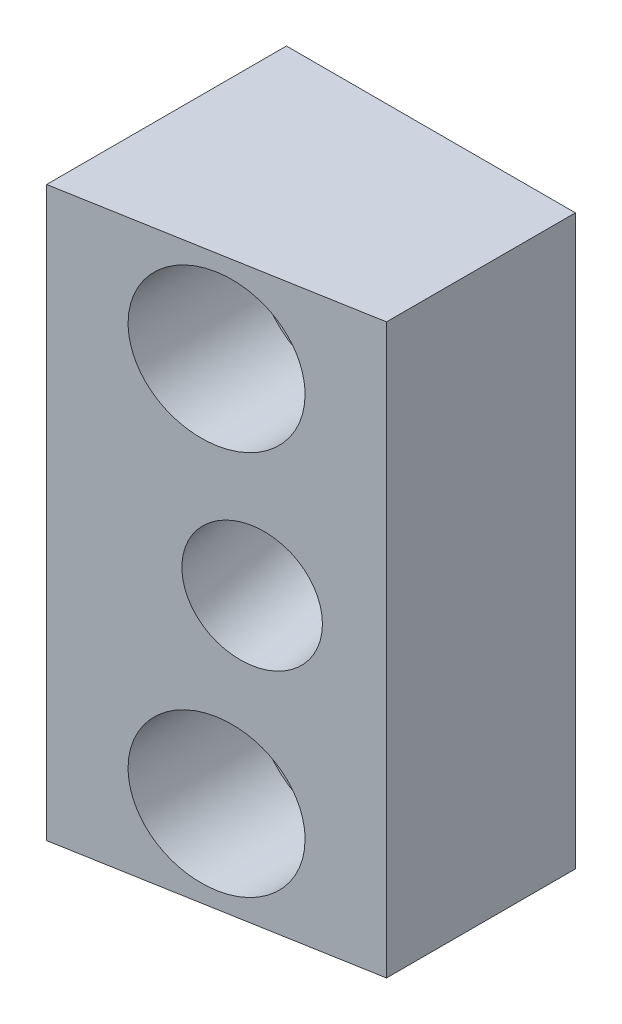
ISO-10303-21;
HEADER;
FILE_DESCRIPTION(('STEP AP214'),'2;1');
FILE_NAME('part.step','',(''),(''),'','','');
FILE_SCHEMA(('AUTOMOTIVE_DESIGN { 1 0 10303 214 1 1 1 1 }'));
ENDSEC;
DATA;
#1=APPLICATION_CONTEXT('core data for automotive mechanical design processes');
#2=APPLICATION_PROTOCOL_DEFINITION('international standard','automotive_design',2000,#1);
#3=PRODUCT_CONTEXT('',#1,'mechanical');
#4=PRODUCT('Part','Part','',(#3));
#5=PRODUCT_RELATED_PRODUCT_CATEGORY('part','',(#4));
#6=PRODUCT_DEFINITION_FORMATION('','',#4);
#7=PRODUCT_DEFINITION_CONTEXT('part definition',#1,'design');
#8=PRODUCT_DEFINITION('design','',#6,#7);
#9=PRODUCT_DEFINITION_SHAPE('','',#8);
#10=(LENGTH_UNIT() NAMED_UNIT(*) SI_UNIT(.MILLI.,.METRE.));
#11=(NAMED_UNIT(*) PLANE_ANGLE_UNIT() SI_UNIT($,.RADIAN.));
#12=(NAMED_UNIT(*) SI_UNIT($,.STERADIAN.) SOLID_ANGLE_UNIT());
#13=UNCERTAINTY_MEASURE_WITH_UNIT(LENGTH_MEASURE(1.E-05),#10,'distance_accuracy_value','');
#14=(GEOMETRIC_REPRESENTATION_CONTEXT(3) GLOBAL_UNCERTAINTY_ASSIGNED_CONTEXT((#13)) GLOBAL_UNIT_ASSIGNED_CONTEXT((#10,
#11,#12)) REPRESENTATION_CONTEXT('',''));
#15=CARTESIAN_POINT('',(0.,0.,0.));
#16=DIRECTION('',(0.,0.,1.));
#17=DIRECTION('',(1.,0.,0.));
#18=AXIS2_PLACEMENT_3D('',#15,#16,#17);
#19=CARTESIAN_POINT('',(19.05,62.865,0.));
#20=DIRECTION('',(0.,0.,1.));
#21=DIRECTION('',(1.,0.,0.));
#22=AXIS2_PLACEMENT_3D('',#19,#20,#21);
#23=PLANE('',#22);
#24=CARTESIAN_POINT('',(-0.871707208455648,25.4,0.));
#25=DIRECTION('',(0.,0.,1.));
#26=DIRECTION('',(1.,0.,0.));
#27=AXIS2_PLACEMENT_3D('',#24,#25,#26);
#28=ELLIPSE('',#27,8.12341289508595,8.);
#29=CARTESIAN_POINT('',(7.2517056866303,25.4,0.));
#30=VERTEX_POINT('',#29);
#31=EDGE_CURVE('E114',#30,#30,#28,.T.);
#32=ORIENTED_EDGE('',*,*,#31,.T.);
#33=EDGE_LOOP('',(#32));
#34=FACE_BOUND('',#33,.T.);
#35=CARTESIAN_POINT('',(0.,0.,0.));
#36=DIRECTION('',(0.,0.,1.));
#37=DIRECTION('',(1.,0.,0.));
#38=AXIS2_PLACEMENT_3D('',#35,#36,#37);
#39=CIRCLE('',#38,6.7437);
#40=CARTESIAN_POINT('',(6.7437,0.,0.));
#41=VERTEX_POINT('',#40);
#42=EDGE_CURVE('E77',#41,#41,#39,.F.);
#43=ORIENTED_EDGE('',*,*,#42,.F.);
#44=EDGE_LOOP('',(#43));
#45=FACE_BOUND('',#44,.T.);
#46=DIRECTION('',(-1.,0.,0.));
#47=VECTOR('',#46,1.);
#48=CARTESIAN_POINT('',(19.05,-12.065,0.));
#49=LINE('',#48,#47);
#50=CARTESIAN_POINT('',(19.05,-12.065,0.));
#51=VERTEX_POINT('',#50);
#52=CARTESIAN_POINT('',(-19.05,-12.065,0.));
#53=VERTEX_POINT('',#52);
#54=EDGE_CURVE('E60',#51,#53,#49,.T.);
#55=ORIENTED_EDGE('',*,*,#54,.T.);
#56=DIRECTION('',(0.,-1.,0.));
#57=VECTOR('',#56,1.);
#58=CARTESIAN_POINT('',(-19.05,62.865,0.));
#59=LINE('',#58,#57);
#60=CARTESIAN_POINT('',(-19.05,62.865,0.));
#61=VERTEX_POINT('',#60);
#62=EDGE_CURVE('E26',#61,#53,#59,.T.);
#63=ORIENTED_EDGE('',*,*,#62,.F.);
#64=DIRECTION('',(-1.,0.,0.));
#65=VECTOR('',#64,1.);
#66=CARTESIAN_POINT('',(19.05,62.865,0.));
#67=LINE('',#66,#65);
#68=CARTESIAN_POINT('',(19.05,62.865,0.));
#69=VERTEX_POINT('',#68);
#70=EDGE_CURVE('E72',#69,#61,#67,.T.);
#71=ORIENTED_EDGE('',*,*,#70,.F.);
#72=DIRECTION('',(0.,-1.,0.));
#73=VECTOR('',#72,1.);
#74=CARTESIAN_POINT('',(19.05,62.865,0.));
#75=LINE('',#74,#73);
#76=EDGE_CURVE('E10',#69,#51,#75,.T.);
#77=ORIENTED_EDGE('',*,*,#76,.T.);
#78=EDGE_LOOP('',(#55,#63,#71,#77));
#79=FACE_BOUND('',#78,.T.);
#80=CARTESIAN_POINT('',(0.,50.8,0.));
#81=DIRECTION('',(0.,0.,1.));
#82=DIRECTION('',(1.,0.,0.));
#83=AXIS2_PLACEMENT_3D('',#80,#81,#82);
#84=CIRCLE('',#83,6.7437);
#85=CARTESIAN_POINT('',(6.7437,50.8,0.));
#86=VERTEX_POINT('',#85);
#87=EDGE_CURVE('E21',#86,#86,#84,.F.);
#88=ORIENTED_EDGE('',*,*,#87,.F.);
#89=EDGE_LOOP('',(#88));
#90=FACE_BOUND('',#89,.T.);
#91=ADVANCED_FACE('F17',(#34,#45,#79,#90),#23,.F.);
#92=CARTESIAN_POINT('',(-19.05,62.865,31.623));
#93=DIRECTION('',(-0.173648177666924,0.,-0.984807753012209));
#94=DIRECTION('',(-0.984807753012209,0.,0.173648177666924));
#95=AXIS2_PLACEMENT_3D('',#92,#93,#94);
#96=PLANE('',#95);
#97=CARTESIAN_POINT('',(3.9880016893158,25.4,27.5607787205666));
#98=DIRECTION('',(0.173648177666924,0.,0.984807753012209));
#99=DIRECTION('',(0.984807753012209,0.,-0.173648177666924));
#100=AXIS2_PLACEMENT_3D('',#97,#98,#99);
#101=CIRCLE('',#100,8.);
#102=CARTESIAN_POINT('',(11.8664637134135,25.4,26.1715932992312));
#103=VERTEX_POINT('',#102);
#104=EDGE_CURVE('E259',#103,#103,#101,.T.);
#105=ORIENTED_EDGE('',*,*,#104,.F.);
#106=EDGE_LOOP('',(#105));
#107=FACE_BOUND('',#106,.T.);
#108=CARTESIAN_POINT('',(0.,0.,28.2639710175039));
#109=DIRECTION('',(-0.173648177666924,0.,-0.984807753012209));
#110=DIRECTION('',(-0.984807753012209,0.,0.173648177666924));
#111=AXIS2_PLACEMENT_3D('',#108,#109,#110);
#112=ELLIPSE('',#111,10.0717119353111,9.9187);
#113=CARTESIAN_POINT('',(-9.91869999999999,0.,30.0129054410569));
#114=VERTEX_POINT('',#113);
#115=EDGE_CURVE('E80',#114,#114,#112,.F.);
#116=ORIENTED_EDGE('',*,*,#115,.F.);
#117=EDGE_LOOP('',(#116));
#118=FACE_BOUND('',#117,.T.);
#119=DIRECTION('',(0.984807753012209,0.,-0.173648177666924));
#120=VECTOR('',#119,1.);
#121=CARTESIAN_POINT('',(-19.05,-12.065,31.623));
#122=LINE('',#121,#120);
#123=CARTESIAN_POINT('',(-19.05,-12.065,31.623));
#124=VERTEX_POINT('',#123);
#125=CARTESIAN_POINT('',(19.05,-12.065,24.9049420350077));
#126=VERTEX_POINT('',#125);
#127=EDGE_CURVE('E88',#124,#126,#122,.T.);
#128=ORIENTED_EDGE('',*,*,#127,.T.);
#129=DIRECTION('',(0.,-1.,0.));
#130=VECTOR('',#129,1.);
#131=CARTESIAN_POINT('',(19.05,62.865,24.9049420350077));
#132=LINE('',#131,#130);
#133=CARTESIAN_POINT('',(19.05,62.865,24.9049420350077));
#134=VERTEX_POINT('',#133);
#135=EDGE_CURVE('E76',#134,#126,#132,.T.);
#136=ORIENTED_EDGE('',*,*,#135,.F.);
#137=DIRECTION('',(0.984807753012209,0.,-0.173648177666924));
#138=VECTOR('',#137,1.);
#139=CARTESIAN_POINT('',(-19.05,62.865,31.623));
#140=LINE('',#139,#138);
#141=CARTESIAN_POINT('',(-19.05,62.865,31.623));
#142=VERTEX_POINT('',#141);
#143=EDGE_CURVE('E34',#142,#134,#140,.T.);
#144=ORIENTED_EDGE('',*,*,#143,.F.);
#145=DIRECTION('',(0.,-1.,0.));
#146=VECTOR('',#145,1.);
#147=CARTESIAN_POINT('',(-19.05,62.865,31.623));
#148=LINE('',#147,#146);
#149=EDGE_CURVE('E96',#142,#124,#148,.T.);
#150=ORIENTED_EDGE('',*,*,#149,.T.);
#151=EDGE_LOOP('',(#128,#136,#144,#150));
#152=FACE_BOUND('',#151,.T.);
#153=CARTESIAN_POINT('',(0.,50.8,28.2639710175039));
#154=DIRECTION('',(-0.173648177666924,0.,-0.984807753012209));
#155=DIRECTION('',(-0.984807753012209,0.,0.173648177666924));
#156=AXIS2_PLACEMENT_3D('',#153,#154,#155);
#157=ELLIPSE('',#156,10.0717119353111,9.9187);
#158=CARTESIAN_POINT('',(-9.91869999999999,50.8,30.0129054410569));
#159=VERTEX_POINT('',#158);
#160=EDGE_CURVE('E101',#159,#159,#157,.F.);
#161=ORIENTED_EDGE('',*,*,#160,.F.);
#162=EDGE_LOOP('',(#161));
#163=FACE_BOUND('',#162,.T.);
#164=ADVANCED_FACE('F143',(#107,#118,#152,#163),#96,.F.);
#165=CARTESIAN_POINT('',(19.05,62.865,24.9049420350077));
#166=DIRECTION('',(-1.,0.,0.));
#167=DIRECTION('',(0.,0.,1.));
#168=AXIS2_PLACEMENT_3D('',#165,#166,#167);
#169=PLANE('',#168);
#170=DIRECTION('',(0.,0.,-1.));
#171=VECTOR('',#170,1.);
#172=CARTESIAN_POINT('',(19.05,-12.065,24.9049420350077));
#173=LINE('',#172,#171);
#174=EDGE_CURVE('E64',#126,#51,#173,.T.);
#175=ORIENTED_EDGE('',*,*,#174,.T.);
#176=ORIENTED_EDGE('',*,*,#76,.F.);
#177=DIRECTION('',(0.,0.,-1.));
#178=VECTOR('',#177,1.);
#179=CARTESIAN_POINT('',(19.05,62.865,24.9049420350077));
#180=LINE('',#179,#178);
#181=EDGE_CURVE('E90',#134,#69,#180,.T.);
#182=ORIENTED_EDGE('',*,*,#181,.F.);
#183=ORIENTED_EDGE('',*,*,#135,.T.);
#184=EDGE_LOOP('',(#175,#176,#182,#183));
#185=FACE_BOUND('',#184,.T.);
#186=ADVANCED_FACE('F19',(#185),#169,.F.);
#187=CARTESIAN_POINT('',(-19.05,62.865,0.));
#188=DIRECTION('',(1.,0.,0.));
#189=DIRECTION('',(0.,1.,0.));
#190=AXIS2_PLACEMENT_3D('',#187,#188,#189);
#191=PLANE('',#190);
#192=DIRECTION('',(0.,0.,1.));
#193=VECTOR('',#192,1.);
#194=CARTESIAN_POINT('',(-19.05,-12.065,0.));
#195=LINE('',#194,#193);
#196=EDGE_CURVE('E65',#53,#124,#195,.T.);
#197=ORIENTED_EDGE('',*,*,#196,.T.);
#198=ORIENTED_EDGE('',*,*,#149,.F.);
#199=DIRECTION('',(0.,0.,1.));
#200=VECTOR('',#199,1.);
#201=CARTESIAN_POINT('',(-19.05,62.865,0.));
#202=LINE('',#201,#200);
#203=EDGE_CURVE('E39',#61,#142,#202,.T.);
#204=ORIENTED_EDGE('',*,*,#203,.F.);
#205=ORIENTED_EDGE('',*,*,#62,.T.);
#206=EDGE_LOOP('',(#197,#198,#204,#205));
#207=FACE_BOUND('',#206,.T.);
#208=ADVANCED_FACE('F154',(#207),#191,.F.);
#209=CARTESIAN_POINT('',(19.05,62.865,0.));
#210=DIRECTION('',(0.,1.,0.));
#211=DIRECTION('',(-1.,0.,0.));
#212=AXIS2_PLACEMENT_3D('',#209,#210,#211);
#213=PLANE('',#212);
#214=ORIENTED_EDGE('',*,*,#181,.T.);
#215=ORIENTED_EDGE('',*,*,#70,.T.);
#216=ORIENTED_EDGE('',*,*,#203,.T.);
#217=ORIENTED_EDGE('',*,*,#143,.T.);
#218=EDGE_LOOP('',(#214,#215,#216,#217));
#219=FACE_BOUND('',#218,.T.);
#220=ADVANCED_FACE('F156',(#219),#213,.T.);
#221=CARTESIAN_POINT('',(19.05,-12.065,0.));
#222=DIRECTION('',(0.,1.,0.));
#223=DIRECTION('',(-1.,0.,0.));
#224=AXIS2_PLACEMENT_3D('',#221,#222,#223);
#225=PLANE('',#224);
#226=ORIENTED_EDGE('',*,*,#174,.F.);
#227=ORIENTED_EDGE('',*,*,#127,.F.);
#228=ORIENTED_EDGE('',*,*,#196,.F.);
#229=ORIENTED_EDGE('',*,*,#54,.F.);
#230=EDGE_LOOP('',(#226,#227,#228,#229));
#231=FACE_BOUND('',#230,.T.);
#232=ADVANCED_FACE('F61',(#231),#225,.F.);
#233=CARTESIAN_POINT('',(0.,0.,18.6715708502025));
#234=DIRECTION('',(0.,0.,1.));
#235=DIRECTION('',(1.,0.,0.));
#236=AXIS2_PLACEMENT_3D('',#233,#234,#235);
#237=CYLINDRICAL_SURFACE('',#236,6.7437);
#238=CARTESIAN_POINT('',(0.,0.,13.208));
#239=DIRECTION('',(0.,0.,1.));
#240=DIRECTION('',(1.,0.,0.));
#241=AXIS2_PLACEMENT_3D('',#238,#239,#240);
#242=CIRCLE('',#241,6.7437);
#243=CARTESIAN_POINT('',(6.7437,0.,13.208));
#244=VERTEX_POINT('',#243);
#245=EDGE_CURVE('E84',#244,#244,#242,.T.);
#246=ORIENTED_EDGE('',*,*,#245,.T.);
#247=EDGE_LOOP('',(#246));
#248=FACE_BOUND('',#247,.T.);
#249=ORIENTED_EDGE('',*,*,#42,.T.);
#250=EDGE_LOOP('',(#249));
#251=FACE_BOUND('',#250,.T.);
#252=ADVANCED_FACE('F123',(#248,#251),#237,.F.);
#253=CARTESIAN_POINT('',(0.,0.,18.6715708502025));
#254=DIRECTION('',(0.,0.,1.));
#255=DIRECTION('',(1.,0.,0.));
#256=AXIS2_PLACEMENT_3D('',#253,#254,#255);
#257=CYLINDRICAL_SURFACE('',#256,9.9187);
#258=CARTESIAN_POINT('',(0.,0.,13.208));
#259=DIRECTION('',(0.,0.,1.));
#260=DIRECTION('',(1.,0.,0.));
#261=AXIS2_PLACEMENT_3D('',#258,#259,#260);
#262=CIRCLE('',#261,9.9187);
#263=CARTESIAN_POINT('',(9.9187,0.,13.208));
#264=VERTEX_POINT('',#263);
#265=EDGE_CURVE('E107',#264,#264,#262,.T.);
#266=ORIENTED_EDGE('',*,*,#265,.F.);
#267=EDGE_LOOP('',(#266));
#268=FACE_BOUND('',#267,.T.);
#269=ORIENTED_EDGE('',*,*,#115,.T.);
#270=EDGE_LOOP('',(#269));
#271=FACE_BOUND('',#270,.T.);
#272=ADVANCED_FACE('F129',(#268,#271),#257,.F.);
#273=CARTESIAN_POINT('',(6.7437,0.,13.208));
#274=DIRECTION('',(0.,0.,1.));
#275=DIRECTION('',(1.,0.,0.));
#276=AXIS2_PLACEMENT_3D('',#273,#274,#275);
#277=PLANE('',#276);
#278=ORIENTED_EDGE('',*,*,#265,.T.);
#279=EDGE_LOOP('',(#278));
#280=FACE_BOUND('',#279,.T.);
#281=ORIENTED_EDGE('',*,*,#245,.F.);
#282=EDGE_LOOP('',(#281));
#283=FACE_BOUND('',#282,.T.);
#284=ADVANCED_FACE('F126',(#280,#283),#277,.T.);
#285=CARTESIAN_POINT('',(0.,50.8,18.6715708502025));
#286=DIRECTION('',(0.,0.,1.));
#287=DIRECTION('',(1.,0.,0.));
#288=AXIS2_PLACEMENT_3D('',#285,#286,#287);
#289=CYLINDRICAL_SURFACE('',#288,6.7437);
#290=CARTESIAN_POINT('',(0.,50.8,13.208));
#291=DIRECTION('',(0.,0.,1.));
#292=DIRECTION('',(1.,0.,0.));
#293=AXIS2_PLACEMENT_3D('',#290,#291,#292);
#294=CIRCLE('',#293,6.7437);
#295=CARTESIAN_POINT('',(6.7437,50.8,13.208));
#296=VERTEX_POINT('',#295);
#297=EDGE_CURVE('E103',#296,#296,#294,.T.);
#298=ORIENTED_EDGE('',*,*,#297,.T.);
#299=EDGE_LOOP('',(#298));
#300=FACE_BOUND('',#299,.T.);
#301=ORIENTED_EDGE('',*,*,#87,.T.);
#302=EDGE_LOOP('',(#301));
#303=FACE_BOUND('',#302,.T.);
#304=ADVANCED_FACE('F128',(#300,#303),#289,.F.);
#305=CARTESIAN_POINT('',(0.,50.8,18.6715708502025));
#306=DIRECTION('',(0.,0.,1.));
#307=DIRECTION('',(1.,0.,0.));
#308=AXIS2_PLACEMENT_3D('',#305,#306,#307);
#309=CYLINDRICAL_SURFACE('',#308,9.9187);
#310=CARTESIAN_POINT('',(0.,50.8,13.208));
#311=DIRECTION('',(0.,0.,1.));
#312=DIRECTION('',(1.,0.,0.));
#313=AXIS2_PLACEMENT_3D('',#310,#311,#312);
#314=CIRCLE('',#313,9.9187);
#315=CARTESIAN_POINT('',(9.9187,50.8,13.208));
#316=VERTEX_POINT('',#315);
#317=EDGE_CURVE('E109',#316,#316,#314,.T.);
#318=ORIENTED_EDGE('',*,*,#317,.F.);
#319=EDGE_LOOP('',(#318));
#320=FACE_BOUND('',#319,.T.);
#321=ORIENTED_EDGE('',*,*,#160,.T.);
#322=EDGE_LOOP('',(#321));
#323=FACE_BOUND('',#322,.T.);
#324=ADVANCED_FACE('F137',(#320,#323),#309,.F.);
#325=CARTESIAN_POINT('',(6.7437,50.8,13.208));
#326=DIRECTION('',(0.,0.,1.));
#327=DIRECTION('',(1.,0.,0.));
#328=AXIS2_PLACEMENT_3D('',#325,#326,#327);
#329=PLANE('',#328);
#330=ORIENTED_EDGE('',*,*,#317,.T.);
#331=EDGE_LOOP('',(#330));
#332=FACE_BOUND('',#331,.T.);
#333=ORIENTED_EDGE('',*,*,#297,.F.);
#334=EDGE_LOOP('',(#333));
#335=FACE_BOUND('',#334,.T.);
#336=ADVANCED_FACE('F227',(#332,#335),#329,.T.);
#337=CARTESIAN_POINT('',(-2.95792541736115,25.4,-11.8315313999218));
#338=DIRECTION('',(0.173648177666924,0.,0.984807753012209));
#339=DIRECTION('',(0.984807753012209,0.,-0.173648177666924));
#340=AXIS2_PLACEMENT_3D('',#337,#338,#339);
#341=CYLINDRICAL_SURFACE('',#340,8.);
#342=ORIENTED_EDGE('',*,*,#104,.T.);
#343=EDGE_LOOP('',(#342));
#344=FACE_BOUND('',#343,.T.);
#345=ORIENTED_EDGE('',*,*,#31,.F.);
#346=EDGE_LOOP('',(#345));
#347=FACE_BOUND('',#346,.T.);
#348=ADVANCED_FACE('F222',(#344,#347),#341,.F.);
#349=CLOSED_SHELL('',(#91,#164,#186,#208,#220,#232,#252,#272,#284,#304,#324,#336,#348));
#350=MANIFOLD_SOLID_BREP('B1',#349);
#351=ADVANCED_BREP_SHAPE_REPRESENTATION('',(#18,#350),#14);
#352=SHAPE_DEFINITION_REPRESENTATION(#9,#351);
ENDSEC;
END-ISO-10303-21;
